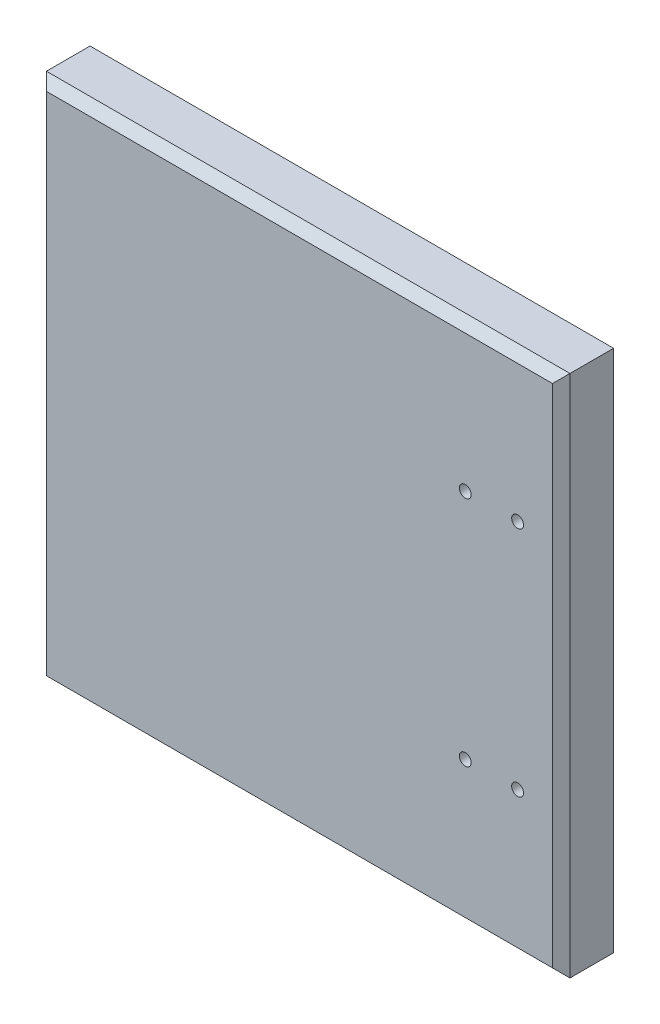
ISO-10303-21;
HEADER;
FILE_DESCRIPTION(('STEP AP214'),'2;1');
FILE_NAME('part.step','',(''),(''),'','','');
FILE_SCHEMA(('AUTOMOTIVE_DESIGN { 1 0 10303 214 1 1 1 1 }'));
ENDSEC;
DATA;
#1=APPLICATION_CONTEXT('core data for automotive mechanical design processes');
#2=APPLICATION_PROTOCOL_DEFINITION('international standard','automotive_design',2000,#1);
#3=PRODUCT_CONTEXT('',#1,'mechanical');
#4=PRODUCT('Part','Part','',(#3));
#5=PRODUCT_RELATED_PRODUCT_CATEGORY('part','',(#4));
#6=PRODUCT_DEFINITION_FORMATION('','',#4);
#7=PRODUCT_DEFINITION_CONTEXT('part definition',#1,'design');
#8=PRODUCT_DEFINITION('design','',#6,#7);
#9=PRODUCT_DEFINITION_SHAPE('','',#8);
#10=(LENGTH_UNIT() NAMED_UNIT(*) SI_UNIT(.MILLI.,.METRE.));
#11=(NAMED_UNIT(*) PLANE_ANGLE_UNIT() SI_UNIT($,.RADIAN.));
#12=(NAMED_UNIT(*) SI_UNIT($,.STERADIAN.) SOLID_ANGLE_UNIT());
#13=UNCERTAINTY_MEASURE_WITH_UNIT(LENGTH_MEASURE(1.E-05),#10,'distance_accuracy_value','');
#14=(GEOMETRIC_REPRESENTATION_CONTEXT(3) GLOBAL_UNCERTAINTY_ASSIGNED_CONTEXT((#13)) GLOBAL_UNIT_ASSIGNED_CONTEXT((#10,
#11,#12)) REPRESENTATION_CONTEXT('',''));
#15=CARTESIAN_POINT('',(0.,0.,0.));
#16=DIRECTION('',(0.,0.,1.));
#17=DIRECTION('',(1.,0.,0.));
#18=AXIS2_PLACEMENT_3D('',#15,#16,#17);
#19=CARTESIAN_POINT('',(-150.000000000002,150.,30.));
#20=DIRECTION('',(1.,0.,0.));
#21=DIRECTION('',(0.,1.,0.));
#22=AXIS2_PLACEMENT_3D('',#19,#20,#21);
#23=PLANE('',#22);
#24=DIRECTION('',(0.,0.,-1.));
#25=VECTOR('',#24,1.);
#26=CARTESIAN_POINT('',(-150.000000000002,-150.,30.));
#27=LINE('',#26,#25);
#28=CARTESIAN_POINT('',(-150.,-150.,25.));
#29=VERTEX_POINT('',#28);
#30=CARTESIAN_POINT('',(-150.,-150.,0.));
#31=VERTEX_POINT('',#30);
#32=EDGE_CURVE('E75',#29,#31,#27,.T.);
#33=ORIENTED_EDGE('',*,*,#32,.F.);
#34=DIRECTION('',(0.,1.,0.));
#35=VECTOR('',#34,1.);
#36=CARTESIAN_POINT('',(-150.,150.,25.));
#37=LINE('',#36,#35);
#38=CARTESIAN_POINT('',(-150.,150.,25.));
#39=VERTEX_POINT('',#38);
#40=EDGE_CURVE('E11',#29,#39,#37,.T.);
#41=ORIENTED_EDGE('',*,*,#40,.T.);
#42=DIRECTION('',(0.,0.,-1.));
#43=VECTOR('',#42,1.);
#44=CARTESIAN_POINT('',(-150.000000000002,150.,30.));
#45=LINE('',#44,#43);
#46=CARTESIAN_POINT('',(-150.,150.,0.));
#47=VERTEX_POINT('',#46);
#48=EDGE_CURVE('E95',#39,#47,#45,.T.);
#49=ORIENTED_EDGE('',*,*,#48,.T.);
#50=DIRECTION('',(0.,-1.,0.));
#51=VECTOR('',#50,1.);
#52=CARTESIAN_POINT('',(-150.,150.,0.));
#53=LINE('',#52,#51);
#54=EDGE_CURVE('E90',#47,#31,#53,.T.);
#55=ORIENTED_EDGE('',*,*,#54,.T.);
#56=EDGE_LOOP('',(#33,#41,#49,#55));
#57=FACE_BOUND('',#56,.T.);
#58=ADVANCED_FACE('F26',(#57),#23,.F.);
#59=CARTESIAN_POINT('',(-150.000000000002,-150.,30.));
#60=DIRECTION('',(0.,1.,0.));
#61=DIRECTION('',(0.,0.,1.));
#62=AXIS2_PLACEMENT_3D('',#59,#60,#61);
#63=PLANE('',#62);
#64=DIRECTION('',(0.,0.,-1.));
#65=VECTOR('',#64,1.);
#66=CARTESIAN_POINT('',(150.,-150.,30.));
#67=LINE('',#66,#65);
#68=CARTESIAN_POINT('',(150.,-150.,25.));
#69=VERTEX_POINT('',#68);
#70=CARTESIAN_POINT('',(150.,-150.,0.));
#71=VERTEX_POINT('',#70);
#72=EDGE_CURVE('E84',#69,#71,#67,.T.);
#73=ORIENTED_EDGE('',*,*,#72,.F.);
#74=DIRECTION('',(-1.,0.,0.));
#75=VECTOR('',#74,1.);
#76=CARTESIAN_POINT('',(-150.,-150.,25.));
#77=LINE('',#76,#75);
#78=EDGE_CURVE('E33',#69,#29,#77,.T.);
#79=ORIENTED_EDGE('',*,*,#78,.T.);
#80=ORIENTED_EDGE('',*,*,#32,.T.);
#81=DIRECTION('',(1.,0.,0.));
#82=VECTOR('',#81,1.);
#83=CARTESIAN_POINT('',(-150.,-150.,0.));
#84=LINE('',#83,#82);
#85=EDGE_CURVE('E78',#31,#71,#84,.T.);
#86=ORIENTED_EDGE('',*,*,#85,.T.);
#87=EDGE_LOOP('',(#73,#79,#80,#86));
#88=FACE_BOUND('',#87,.T.);
#89=ADVANCED_FACE('F77',(#88),#63,.F.);
#90=CARTESIAN_POINT('',(150.,150.,30.));
#91=DIRECTION('',(-1.,0.,0.));
#92=DIRECTION('',(0.,-1.,0.));
#93=AXIS2_PLACEMENT_3D('',#90,#91,#92);
#94=PLANE('',#93);
#95=DIRECTION('',(0.,0.,-1.));
#96=VECTOR('',#95,1.);
#97=CARTESIAN_POINT('',(150.,150.,30.));
#98=LINE('',#97,#96);
#99=CARTESIAN_POINT('',(150.,150.,25.));
#100=VERTEX_POINT('',#99);
#101=CARTESIAN_POINT('',(150.,150.,0.));
#102=VERTEX_POINT('',#101);
#103=EDGE_CURVE('E108',#100,#102,#98,.T.);
#104=ORIENTED_EDGE('',*,*,#103,.F.);
#105=DIRECTION('',(0.,-1.,0.));
#106=VECTOR('',#105,1.);
#107=CARTESIAN_POINT('',(150.,-150.,25.));
#108=LINE('',#107,#106);
#109=EDGE_CURVE('E47',#100,#69,#108,.T.);
#110=ORIENTED_EDGE('',*,*,#109,.T.);
#111=ORIENTED_EDGE('',*,*,#72,.T.);
#112=DIRECTION('',(0.,1.,0.));
#113=VECTOR('',#112,1.);
#114=CARTESIAN_POINT('',(150.,150.,0.));
#115=LINE('',#114,#113);
#116=EDGE_CURVE('E92',#71,#102,#115,.T.);
#117=ORIENTED_EDGE('',*,*,#116,.T.);
#118=EDGE_LOOP('',(#104,#110,#111,#117));
#119=FACE_BOUND('',#118,.T.);
#120=ADVANCED_FACE('F127',(#119),#94,.F.);
#121=CARTESIAN_POINT('',(-150.000000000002,150.,30.));
#122=DIRECTION('',(0.,-1.,0.));
#123=DIRECTION('',(0.,0.,-1.));
#124=AXIS2_PLACEMENT_3D('',#121,#122,#123);
#125=PLANE('',#124);
#126=ORIENTED_EDGE('',*,*,#48,.F.);
#127=DIRECTION('',(1.,0.,0.));
#128=VECTOR('',#127,1.);
#129=CARTESIAN_POINT('',(150.,150.,25.));
#130=LINE('',#129,#128);
#131=EDGE_CURVE('E119',#39,#100,#130,.T.);
#132=ORIENTED_EDGE('',*,*,#131,.T.);
#133=ORIENTED_EDGE('',*,*,#103,.T.);
#134=DIRECTION('',(-1.,0.,0.));
#135=VECTOR('',#134,1.);
#136=CARTESIAN_POINT('',(-150.,150.,0.));
#137=LINE('',#136,#135);
#138=EDGE_CURVE('E105',#102,#47,#137,.T.);
#139=ORIENTED_EDGE('',*,*,#138,.T.);
#140=EDGE_LOOP('',(#126,#132,#133,#139));
#141=FACE_BOUND('',#140,.T.);
#142=ADVANCED_FACE('F124',(#141),#125,.F.);
#143=CARTESIAN_POINT('',(-150.000000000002,-150.,30.));
#144=DIRECTION('',(0.,0.,1.));
#145=DIRECTION('',(1.,0.,0.));
#146=AXIS2_PLACEMENT_3D('',#143,#144,#145);
#147=PLANE('',#146);
#148=CARTESIAN_POINT('',(124.999999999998,-66.4999999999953,29.9999999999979));
#149=DIRECTION('',(0.,0.,1.));
#150=DIRECTION('',(1.,0.,0.));
#151=AXIS2_PLACEMENT_3D('',#148,#149,#150);
#152=CIRCLE('',#151,3.4);
#153=CARTESIAN_POINT('',(128.399999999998,-66.4999999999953,29.9999999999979));
#154=VERTEX_POINT('',#153);
#155=EDGE_CURVE('E167',#154,#154,#152,.T.);
#156=ORIENTED_EDGE('',*,*,#155,.F.);
#157=EDGE_LOOP('',(#156));
#158=FACE_BOUND('',#157,.T.);
#159=CARTESIAN_POINT('',(94.999999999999,66.499999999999,30.));
#160=DIRECTION('',(0.,0.,1.));
#161=DIRECTION('',(1.,0.,0.));
#162=AXIS2_PLACEMENT_3D('',#159,#160,#161);
#163=CIRCLE('',#162,3.39999999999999);
#164=CARTESIAN_POINT('',(98.399999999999,66.499999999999,30.));
#165=VERTEX_POINT('',#164);
#166=EDGE_CURVE('E161',#165,#165,#163,.T.);
#167=ORIENTED_EDGE('',*,*,#166,.F.);
#168=EDGE_LOOP('',(#167));
#169=FACE_BOUND('',#168,.T.);
#170=CARTESIAN_POINT('',(124.999999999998,66.5000000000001,30.));
#171=DIRECTION('',(0.,0.,1.));
#172=DIRECTION('',(1.,0.,0.));
#173=AXIS2_PLACEMENT_3D('',#170,#171,#172);
#174=CIRCLE('',#173,3.4);
#175=CARTESIAN_POINT('',(128.399999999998,66.5000000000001,30.));
#176=VERTEX_POINT('',#175);
#177=EDGE_CURVE('E155',#176,#176,#174,.T.);
#178=ORIENTED_EDGE('',*,*,#177,.F.);
#179=EDGE_LOOP('',(#178));
#180=FACE_BOUND('',#179,.T.);
#181=CARTESIAN_POINT('',(94.999999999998,-66.4999999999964,30.));
#182=DIRECTION('',(0.,0.,1.));
#183=DIRECTION('',(1.,0.,0.));
#184=AXIS2_PLACEMENT_3D('',#181,#182,#183);
#185=CIRCLE('',#184,3.39999999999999);
#186=CARTESIAN_POINT('',(98.399999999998,-66.4999999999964,30.));
#187=VERTEX_POINT('',#186);
#188=EDGE_CURVE('E149',#187,#187,#185,.T.);
#189=ORIENTED_EDGE('',*,*,#188,.F.);
#190=EDGE_LOOP('',(#189));
#191=FACE_BOUND('',#190,.T.);
#192=DIRECTION('',(0.,1.,0.));
#193=VECTOR('',#192,1.);
#194=CARTESIAN_POINT('',(145.,150.,30.));
#195=LINE('',#194,#193);
#196=CARTESIAN_POINT('',(145.,-145.,30.));
#197=VERTEX_POINT('',#196);
#198=CARTESIAN_POINT('',(145.,145.,30.));
#199=VERTEX_POINT('',#198);
#200=EDGE_CURVE('E114',#197,#199,#195,.T.);
#201=ORIENTED_EDGE('',*,*,#200,.T.);
#202=DIRECTION('',(-1.,0.,0.));
#203=VECTOR('',#202,1.);
#204=CARTESIAN_POINT('',(-150.000000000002,145.,30.));
#205=LINE('',#204,#203);
#206=CARTESIAN_POINT('',(-145.000000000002,145.000000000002,30.));
#207=VERTEX_POINT('',#206);
#208=EDGE_CURVE('E116',#199,#207,#205,.T.);
#209=ORIENTED_EDGE('',*,*,#208,.T.);
#210=DIRECTION('',(0.,-1.,0.));
#211=VECTOR('',#210,1.);
#212=CARTESIAN_POINT('',(-145.000000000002,-149.999999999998,30.));
#213=LINE('',#212,#211);
#214=CARTESIAN_POINT('',(-145.000000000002,-144.999999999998,30.));
#215=VERTEX_POINT('',#214);
#216=EDGE_CURVE('E83',#207,#215,#213,.T.);
#217=ORIENTED_EDGE('',*,*,#216,.T.);
#218=DIRECTION('',(1.,0.,0.));
#219=VECTOR('',#218,1.);
#220=CARTESIAN_POINT('',(150.,-145.,30.));
#221=LINE('',#220,#219);
#222=EDGE_CURVE('E112',#215,#197,#221,.T.);
#223=ORIENTED_EDGE('',*,*,#222,.T.);
#224=EDGE_LOOP('',(#201,#209,#217,#223));
#225=FACE_BOUND('',#224,.T.);
#226=ADVANCED_FACE('F141',(#158,#169,#180,#191,#225),#147,.T.);
#227=CARTESIAN_POINT('',(-150.,-150.,0.));
#228=DIRECTION('',(0.,0.,1.));
#229=DIRECTION('',(1.,0.,0.));
#230=AXIS2_PLACEMENT_3D('',#227,#228,#229);
#231=PLANE('',#230);
#232=CARTESIAN_POINT('',(124.999999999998,-66.4999999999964,-2.13717932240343E-12));
#233=DIRECTION('',(0.,0.,1.));
#234=DIRECTION('',(1.,0.,0.));
#235=AXIS2_PLACEMENT_3D('',#232,#233,#234);
#236=CIRCLE('',#235,3.4);
#237=CARTESIAN_POINT('',(128.399999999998,-66.4999999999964,-2.13717932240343E-12));
#238=VERTEX_POINT('',#237);
#239=EDGE_CURVE('E170',#238,#238,#236,.T.);
#240=ORIENTED_EDGE('',*,*,#239,.T.);
#241=EDGE_LOOP('',(#240));
#242=FACE_BOUND('',#241,.T.);
#243=CARTESIAN_POINT('',(94.999999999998,66.499999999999,0.));
#244=DIRECTION('',(0.,0.,1.));
#245=DIRECTION('',(1.,0.,0.));
#246=AXIS2_PLACEMENT_3D('',#243,#244,#245);
#247=CIRCLE('',#246,3.39999999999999);
#248=CARTESIAN_POINT('',(98.399999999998,66.499999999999,0.));
#249=VERTEX_POINT('',#248);
#250=EDGE_CURVE('E164',#249,#249,#247,.T.);
#251=ORIENTED_EDGE('',*,*,#250,.T.);
#252=EDGE_LOOP('',(#251));
#253=FACE_BOUND('',#252,.T.);
#254=CARTESIAN_POINT('',(124.999999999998,66.499999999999,0.));
#255=DIRECTION('',(0.,0.,1.));
#256=DIRECTION('',(1.,0.,0.));
#257=AXIS2_PLACEMENT_3D('',#254,#255,#256);
#258=CIRCLE('',#257,3.4);
#259=CARTESIAN_POINT('',(128.399999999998,66.499999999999,0.));
#260=VERTEX_POINT('',#259);
#261=EDGE_CURVE('E158',#260,#260,#258,.T.);
#262=ORIENTED_EDGE('',*,*,#261,.T.);
#263=EDGE_LOOP('',(#262));
#264=FACE_BOUND('',#263,.T.);
#265=CARTESIAN_POINT('',(94.999999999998,-66.4999999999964,0.));
#266=DIRECTION('',(0.,0.,1.));
#267=DIRECTION('',(1.,0.,0.));
#268=AXIS2_PLACEMENT_3D('',#265,#266,#267);
#269=CIRCLE('',#268,3.39999999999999);
#270=CARTESIAN_POINT('',(98.399999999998,-66.4999999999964,0.));
#271=VERTEX_POINT('',#270);
#272=EDGE_CURVE('E152',#271,#271,#269,.T.);
#273=ORIENTED_EDGE('',*,*,#272,.T.);
#274=EDGE_LOOP('',(#273));
#275=FACE_BOUND('',#274,.T.);
#276=ORIENTED_EDGE('',*,*,#54,.F.);
#277=ORIENTED_EDGE('',*,*,#138,.F.);
#278=ORIENTED_EDGE('',*,*,#116,.F.);
#279=ORIENTED_EDGE('',*,*,#85,.F.);
#280=EDGE_LOOP('',(#276,#277,#278,#279));
#281=FACE_BOUND('',#280,.T.);
#282=ADVANCED_FACE('F88',(#242,#253,#264,#275,#281),#231,.F.);
#283=CARTESIAN_POINT('',(-150.000000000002,-145.,30.));
#284=DIRECTION('',(0.,-0.707106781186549,0.707106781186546));
#285=DIRECTION('',(0.,-0.707106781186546,-0.707106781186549));
#286=AXIS2_PLACEMENT_3D('',#283,#284,#285);
#287=PLANE('',#286);
#288=DIRECTION('',(0.577350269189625,0.577350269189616,0.577350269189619));
#289=VECTOR('',#288,1.);
#290=CARTESIAN_POINT('',(-146.666666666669,-146.666666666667,28.3333333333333));
#291=LINE('',#290,#289);
#292=EDGE_CURVE('E100',#29,#215,#291,.T.);
#293=ORIENTED_EDGE('',*,*,#292,.F.);
#294=ORIENTED_EDGE('',*,*,#78,.F.);
#295=DIRECTION('',(-0.577350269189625,0.577350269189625,0.577350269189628));
#296=VECTOR('',#295,1.);
#297=CARTESIAN_POINT('',(46.666666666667,-46.666666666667,128.333333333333));
#298=LINE('',#297,#296);
#299=EDGE_CURVE('E97',#197,#69,#298,.F.);
#300=ORIENTED_EDGE('',*,*,#299,.F.);
#301=ORIENTED_EDGE('',*,*,#222,.F.);
#302=EDGE_LOOP('',(#293,#294,#300,#301));
#303=FACE_BOUND('',#302,.T.);
#304=ADVANCED_FACE('F130',(#303),#287,.T.);
#305=CARTESIAN_POINT('',(145.,-150.,30.));
#306=DIRECTION('',(0.707106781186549,0.,0.707106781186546));
#307=DIRECTION('',(0.707106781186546,0.,-0.707106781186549));
#308=AXIS2_PLACEMENT_3D('',#305,#306,#307);
#309=PLANE('',#308);
#310=ORIENTED_EDGE('',*,*,#299,.T.);
#311=ORIENTED_EDGE('',*,*,#109,.F.);
#312=DIRECTION('',(-0.577350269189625,-0.577350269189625,0.577350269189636));
#313=VECTOR('',#312,1.);
#314=CARTESIAN_POINT('',(46.6666666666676,46.666666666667,128.333333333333));
#315=LINE('',#314,#313);
#316=EDGE_CURVE('E138',#199,#100,#315,.F.);
#317=ORIENTED_EDGE('',*,*,#316,.F.);
#318=ORIENTED_EDGE('',*,*,#200,.F.);
#319=EDGE_LOOP('',(#310,#311,#317,#318));
#320=FACE_BOUND('',#319,.T.);
#321=ADVANCED_FACE('F136',(#320),#309,.T.);
#322=CARTESIAN_POINT('',(-145.000000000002,-149.999999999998,30.));
#323=DIRECTION('',(-0.707106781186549,0.,0.707106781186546));
#324=DIRECTION('',(0.707106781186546,0.,0.707106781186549));
#325=AXIS2_PLACEMENT_3D('',#322,#323,#324);
#326=PLANE('',#325);
#327=ORIENTED_EDGE('',*,*,#292,.T.);
#328=ORIENTED_EDGE('',*,*,#216,.F.);
#329=DIRECTION('',(-0.577350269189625,0.577350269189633,-0.577350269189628));
#330=VECTOR('',#329,1.);
#331=CARTESIAN_POINT('',(-46.6666666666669,46.666666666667,128.333333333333));
#332=LINE('',#331,#330);
#333=EDGE_CURVE('E145',#39,#207,#332,.F.);
#334=ORIENTED_EDGE('',*,*,#333,.F.);
#335=ORIENTED_EDGE('',*,*,#40,.F.);
#336=EDGE_LOOP('',(#327,#328,#334,#335));
#337=FACE_BOUND('',#336,.T.);
#338=ADVANCED_FACE('F144',(#337),#326,.T.);
#339=CARTESIAN_POINT('',(-150.000000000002,145.,30.));
#340=DIRECTION('',(0.,0.707106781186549,0.707106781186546));
#341=DIRECTION('',(0.,-0.707106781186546,0.707106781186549));
#342=AXIS2_PLACEMENT_3D('',#339,#340,#341);
#343=PLANE('',#342);
#344=ORIENTED_EDGE('',*,*,#316,.T.);
#345=ORIENTED_EDGE('',*,*,#131,.F.);
#346=ORIENTED_EDGE('',*,*,#333,.T.);
#347=ORIENTED_EDGE('',*,*,#208,.F.);
#348=EDGE_LOOP('',(#344,#345,#346,#347));
#349=FACE_BOUND('',#348,.T.);
#350=ADVANCED_FACE('F195',(#349),#343,.T.);
#351=CARTESIAN_POINT('',(94.999999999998,-66.4999999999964,30.));
#352=DIRECTION('',(0.,0.,1.));
#353=DIRECTION('',(1.,0.,0.));
#354=AXIS2_PLACEMENT_3D('',#351,#352,#353);
#355=CYLINDRICAL_SURFACE('',#354,3.39999999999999);
#356=ORIENTED_EDGE('',*,*,#272,.F.);
#357=EDGE_LOOP('',(#356));
#358=FACE_BOUND('',#357,.T.);
#359=ORIENTED_EDGE('',*,*,#188,.T.);
#360=EDGE_LOOP('',(#359));
#361=FACE_BOUND('',#360,.T.);
#362=ADVANCED_FACE('F192',(#358,#361),#355,.F.);
#363=CARTESIAN_POINT('',(124.999999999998,66.5000000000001,30.));
#364=DIRECTION('',(0.,0.,1.));
#365=DIRECTION('',(1.,0.,0.));
#366=AXIS2_PLACEMENT_3D('',#363,#364,#365);
#367=CYLINDRICAL_SURFACE('',#366,3.4);
#368=ORIENTED_EDGE('',*,*,#261,.F.);
#369=EDGE_LOOP('',(#368));
#370=FACE_BOUND('',#369,.T.);
#371=ORIENTED_EDGE('',*,*,#177,.T.);
#372=EDGE_LOOP('',(#371));
#373=FACE_BOUND('',#372,.T.);
#374=ADVANCED_FACE('F194',(#370,#373),#367,.F.);
#375=CARTESIAN_POINT('',(94.999999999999,66.499999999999,30.));
#376=DIRECTION('',(0.,0.,1.));
#377=DIRECTION('',(1.,0.,0.));
#378=AXIS2_PLACEMENT_3D('',#375,#376,#377);
#379=CYLINDRICAL_SURFACE('',#378,3.39999999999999);
#380=ORIENTED_EDGE('',*,*,#250,.F.);
#381=EDGE_LOOP('',(#380));
#382=FACE_BOUND('',#381,.T.);
#383=ORIENTED_EDGE('',*,*,#166,.T.);
#384=EDGE_LOOP('',(#383));
#385=FACE_BOUND('',#384,.T.);
#386=ADVANCED_FACE('F179',(#382,#385),#379,.F.);
#387=CARTESIAN_POINT('',(124.999999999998,-66.4999999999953,29.9999999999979));
#388=DIRECTION('',(0.,0.,1.));
#389=DIRECTION('',(1.,0.,0.));
#390=AXIS2_PLACEMENT_3D('',#387,#388,#389);
#391=CYLINDRICAL_SURFACE('',#390,3.4);
#392=ORIENTED_EDGE('',*,*,#239,.F.);
#393=EDGE_LOOP('',(#392));
#394=FACE_BOUND('',#393,.T.);
#395=ORIENTED_EDGE('',*,*,#155,.T.);
#396=EDGE_LOOP('',(#395));
#397=FACE_BOUND('',#396,.T.);
#398=ADVANCED_FACE('F176',(#394,#397),#391,.F.);
#399=CLOSED_SHELL('',(#58,#89,#120,#142,#226,#282,#304,#321,#338,#350,#362,#374,#386,#398));
#400=MANIFOLD_SOLID_BREP('B2',#399);
#401=ADVANCED_BREP_SHAPE_REPRESENTATION('',(#18,#400),#14);
#402=SHAPE_DEFINITION_REPRESENTATION(#9,#401);
ENDSEC;
END-ISO-10303-21;
